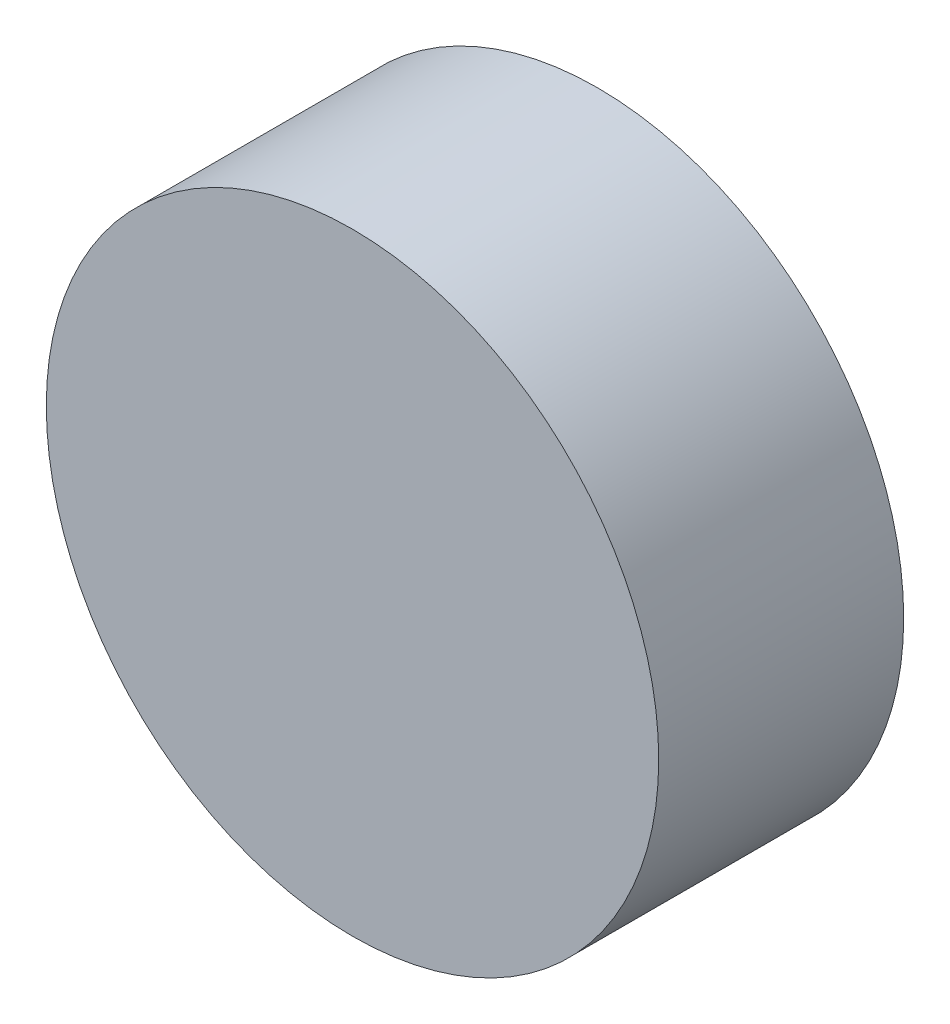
from build123d import *

# Parameters (mm, degrees)
EXTRUDE1_DEPTH      = 10
EXTRUDE1_DEPTH_BACK = 10
SKETCH1_R           = 25


with BuildPart() as part:
    # Sketch1 → Extrude1 (new, two sides: drawn at the far end of the back side and taken through both)
    with BuildSketch(Plane.XY.offset(-EXTRUDE1_DEPTH_BACK)):
        Circle(SKETCH1_R)
    extrude(amount=EXTRUDE1_DEPTH + EXTRUDE1_DEPTH_BACK)


solid = part.part
